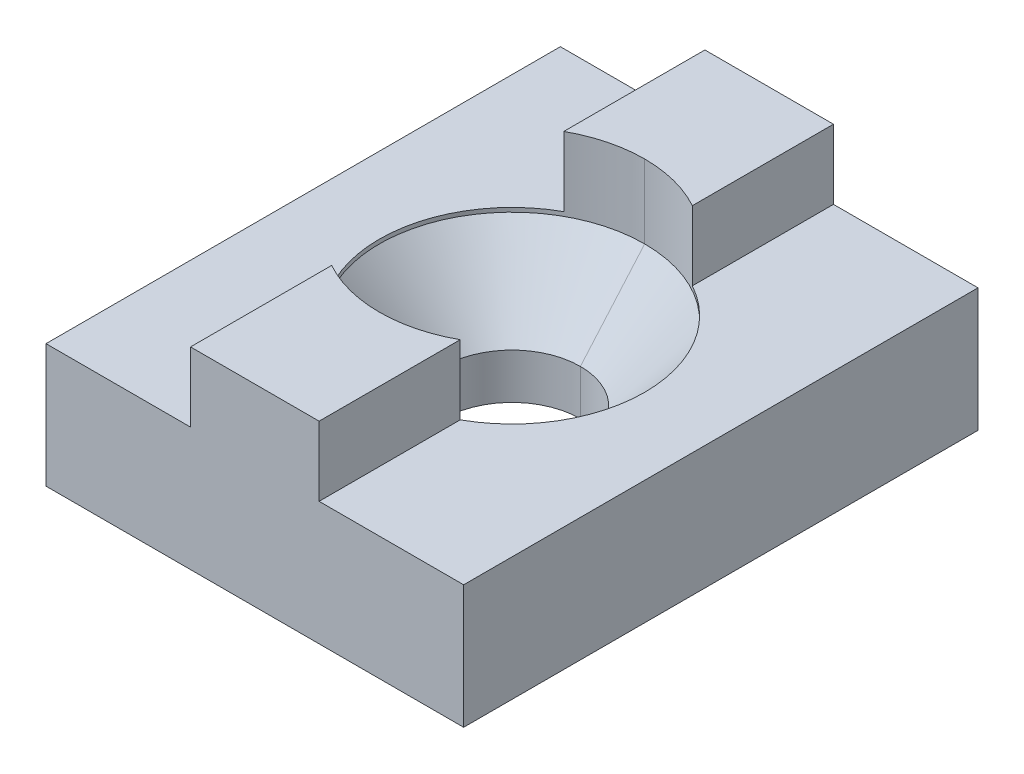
ISO-10303-21;
HEADER;
FILE_DESCRIPTION(('STEP AP214'),'2;1');
FILE_NAME('part.step','',(''),(''),'','','');
FILE_SCHEMA(('AUTOMOTIVE_DESIGN { 1 0 10303 214 1 1 1 1 }'));
ENDSEC;
DATA;
#1=APPLICATION_CONTEXT('core data for automotive mechanical design processes');
#2=APPLICATION_PROTOCOL_DEFINITION('international standard','automotive_design',2000,#1);
#3=PRODUCT_CONTEXT('',#1,'mechanical');
#4=PRODUCT('Part','Part','',(#3));
#5=PRODUCT_RELATED_PRODUCT_CATEGORY('part','',(#4));
#6=PRODUCT_DEFINITION_FORMATION('','',#4);
#7=PRODUCT_DEFINITION_CONTEXT('part definition',#1,'design');
#8=PRODUCT_DEFINITION('design','',#6,#7);
#9=PRODUCT_DEFINITION_SHAPE('','',#8);
#10=(LENGTH_UNIT() NAMED_UNIT(*) SI_UNIT(.MILLI.,.METRE.));
#11=(NAMED_UNIT(*) PLANE_ANGLE_UNIT() SI_UNIT($,.RADIAN.));
#12=(NAMED_UNIT(*) SI_UNIT($,.STERADIAN.) SOLID_ANGLE_UNIT());
#13=UNCERTAINTY_MEASURE_WITH_UNIT(LENGTH_MEASURE(1.E-05),#10,'distance_accuracy_value','');
#14=(GEOMETRIC_REPRESENTATION_CONTEXT(3) GLOBAL_UNCERTAINTY_ASSIGNED_CONTEXT((#13)) GLOBAL_UNIT_ASSIGNED_CONTEXT((#10,
#11,#12)) REPRESENTATION_CONTEXT('',''));
#15=CARTESIAN_POINT('',(0.,0.,0.));
#16=DIRECTION('',(0.,0.,1.));
#17=DIRECTION('',(1.,0.,0.));
#18=AXIS2_PLACEMENT_3D('',#15,#16,#17);
#19=CARTESIAN_POINT('',(-10.3124,0.,12.7));
#20=DIRECTION('',(0.,1.,0.));
#21=DIRECTION('',(0.,0.,1.));
#22=AXIS2_PLACEMENT_3D('',#19,#20,#21);
#23=PLANE('',#22);
#24=CARTESIAN_POINT('',(0.,0.,0.));
#25=DIRECTION('',(0.,-1.,0.));
#26=DIRECTION('',(0.,0.,-1.));
#27=AXIS2_PLACEMENT_3D('',#24,#25,#26);
#28=CIRCLE('',#27,3.3782);
#29=CARTESIAN_POINT('',(0.,0.,-3.3782));
#30=VERTEX_POINT('',#29);
#31=CARTESIAN_POINT('',(0.,0.,3.3782));
#32=VERTEX_POINT('',#31);
#33=EDGE_CURVE('E11',#30,#32,#28,.T.);
#34=ORIENTED_EDGE('',*,*,#33,.F.);
#35=CARTESIAN_POINT('',(0.,0.,0.));
#36=DIRECTION('',(0.,-1.,0.));
#37=DIRECTION('',(0.,0.,-1.));
#38=AXIS2_PLACEMENT_3D('',#35,#36,#37);
#39=CIRCLE('',#38,3.3782);
#40=EDGE_CURVE('E25',#32,#30,#39,.T.);
#41=ORIENTED_EDGE('',*,*,#40,.F.);
#42=EDGE_LOOP('',(#34,#41));
#43=FACE_BOUND('',#42,.T.);
#44=DIRECTION('',(1.,0.,0.));
#45=VECTOR('',#44,1.);
#46=CARTESIAN_POINT('',(-10.3124,0.,-12.7));
#47=LINE('',#46,#45);
#48=CARTESIAN_POINT('',(-10.3124,0.,-12.7));
#49=VERTEX_POINT('',#48);
#50=CARTESIAN_POINT('',(10.3124,0.,-12.7));
#51=VERTEX_POINT('',#50);
#52=EDGE_CURVE('E402',#49,#51,#47,.T.);
#53=ORIENTED_EDGE('',*,*,#52,.T.);
#54=DIRECTION('',(0.,0.,-1.));
#55=VECTOR('',#54,1.);
#56=CARTESIAN_POINT('',(10.3124,0.,12.7));
#57=LINE('',#56,#55);
#58=CARTESIAN_POINT('',(10.3124,0.,12.7));
#59=VERTEX_POINT('',#58);
#60=EDGE_CURVE('E397',#59,#51,#57,.T.);
#61=ORIENTED_EDGE('',*,*,#60,.F.);
#62=DIRECTION('',(1.,0.,0.));
#63=VECTOR('',#62,1.);
#64=CARTESIAN_POINT('',(-10.3124,0.,12.7));
#65=LINE('',#64,#63);
#66=CARTESIAN_POINT('',(-10.3124,0.,12.7));
#67=VERTEX_POINT('',#66);
#68=EDGE_CURVE('E392',#67,#59,#65,.T.);
#69=ORIENTED_EDGE('',*,*,#68,.F.);
#70=DIRECTION('',(0.,0.,-1.));
#71=VECTOR('',#70,1.);
#72=CARTESIAN_POINT('',(-10.3124,0.,12.7));
#73=LINE('',#72,#71);
#74=EDGE_CURVE('E388',#67,#49,#73,.T.);
#75=ORIENTED_EDGE('',*,*,#74,.T.);
#76=EDGE_LOOP('',(#53,#61,#69,#75));
#77=FACE_BOUND('',#76,.T.);
#78=ADVANCED_FACE('F17',(#43,#77),#23,.F.);
#79=CARTESIAN_POINT('',(-10.3124,6.096,12.7));
#80=DIRECTION('',(1.,0.,0.));
#81=DIRECTION('',(0.,0.,-1.));
#82=AXIS2_PLACEMENT_3D('',#79,#80,#81);
#83=PLANE('',#82);
#84=DIRECTION('',(0.,-1.,0.));
#85=VECTOR('',#84,1.);
#86=CARTESIAN_POINT('',(-10.3124,6.096,-12.7));
#87=LINE('',#86,#85);
#88=CARTESIAN_POINT('',(-10.3124,6.096,-12.7));
#89=VERTEX_POINT('',#88);
#90=EDGE_CURVE('E383',#89,#49,#87,.T.);
#91=ORIENTED_EDGE('',*,*,#90,.T.);
#92=ORIENTED_EDGE('',*,*,#74,.F.);
#93=DIRECTION('',(0.,-1.,0.));
#94=VECTOR('',#93,1.);
#95=CARTESIAN_POINT('',(-10.3124,6.096,12.7));
#96=LINE('',#95,#94);
#97=CARTESIAN_POINT('',(-10.3124,6.096,12.7));
#98=VERTEX_POINT('',#97);
#99=EDGE_CURVE('E378',#98,#67,#96,.T.);
#100=ORIENTED_EDGE('',*,*,#99,.F.);
#101=DIRECTION('',(0.,0.,-1.));
#102=VECTOR('',#101,1.);
#103=CARTESIAN_POINT('',(-10.3124,6.096,12.7));
#104=LINE('',#103,#102);
#105=EDGE_CURVE('E374',#98,#89,#104,.T.);
#106=ORIENTED_EDGE('',*,*,#105,.T.);
#107=EDGE_LOOP('',(#91,#92,#100,#106));
#108=FACE_BOUND('',#107,.T.);
#109=ADVANCED_FACE('F427',(#108),#83,.F.);
#110=CARTESIAN_POINT('',(-3.175,6.096,12.7));
#111=DIRECTION('',(0.,-1.,0.));
#112=DIRECTION('',(0.,0.,-1.));
#113=AXIS2_PLACEMENT_3D('',#110,#111,#112);
#114=PLANE('',#113);
#115=CARTESIAN_POINT('',(0.,6.096,0.));
#116=DIRECTION('',(0.,-1.,0.));
#117=DIRECTION('',(0.,0.,-1.));
#118=AXIS2_PLACEMENT_3D('',#115,#116,#117);
#119=CIRCLE('',#118,6.552118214);
#120=CARTESIAN_POINT('',(-3.175,6.096,5.73145950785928));
#121=VERTEX_POINT('',#120);
#122=CARTESIAN_POINT('',(-3.175,6.096,-5.73145950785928));
#123=VERTEX_POINT('',#122);
#124=EDGE_CURVE('E370',#121,#123,#119,.T.);
#125=ORIENTED_EDGE('',*,*,#124,.T.);
#126=DIRECTION('',(0.,0.,-1.));
#127=VECTOR('',#126,1.);
#128=CARTESIAN_POINT('',(-3.175,6.096,12.7));
#129=LINE('',#128,#127);
#130=CARTESIAN_POINT('',(-3.175,6.096,-12.7));
#131=VERTEX_POINT('',#130);
#132=EDGE_CURVE('E366',#123,#131,#129,.T.);
#133=ORIENTED_EDGE('',*,*,#132,.T.);
#134=DIRECTION('',(-1.,0.,0.));
#135=VECTOR('',#134,1.);
#136=CARTESIAN_POINT('',(-3.175,6.096,-12.7));
#137=LINE('',#136,#135);
#138=EDGE_CURVE('E361',#131,#89,#137,.T.);
#139=ORIENTED_EDGE('',*,*,#138,.T.);
#140=ORIENTED_EDGE('',*,*,#105,.F.);
#141=DIRECTION('',(-1.,0.,0.));
#142=VECTOR('',#141,1.);
#143=CARTESIAN_POINT('',(-3.175,6.096,12.7));
#144=LINE('',#143,#142);
#145=CARTESIAN_POINT('',(-3.175,6.096,12.7));
#146=VERTEX_POINT('',#145);
#147=EDGE_CURVE('E356',#146,#98,#144,.T.);
#148=ORIENTED_EDGE('',*,*,#147,.F.);
#149=DIRECTION('',(0.,0.,-1.));
#150=VECTOR('',#149,1.);
#151=CARTESIAN_POINT('',(-3.175,6.096,12.7));
#152=LINE('',#151,#150);
#153=EDGE_CURVE('E352',#146,#121,#152,.T.);
#154=ORIENTED_EDGE('',*,*,#153,.T.);
#155=EDGE_LOOP('',(#125,#133,#139,#140,#148,#154));
#156=FACE_BOUND('',#155,.T.);
#157=ADVANCED_FACE('F455',(#156),#114,.F.);
#158=CARTESIAN_POINT('',(-3.175,9.525,12.7));
#159=DIRECTION('',(1.,0.,0.));
#160=DIRECTION('',(0.,0.,-1.));
#161=AXIS2_PLACEMENT_3D('',#158,#159,#160);
#162=PLANE('',#161);
#163=DIRECTION('',(0.,-1.,0.));
#164=VECTOR('',#163,1.);
#165=CARTESIAN_POINT('',(-3.175,0.,5.73145950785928));
#166=LINE('',#165,#164);
#167=CARTESIAN_POINT('',(-3.175,9.525,5.73145950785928));
#168=VERTEX_POINT('',#167);
#169=EDGE_CURVE('E347',#168,#121,#166,.T.);
#170=ORIENTED_EDGE('',*,*,#169,.T.);
#171=ORIENTED_EDGE('',*,*,#153,.F.);
#172=DIRECTION('',(0.,-1.,0.));
#173=VECTOR('',#172,1.);
#174=CARTESIAN_POINT('',(-3.175,9.525,12.7));
#175=LINE('',#174,#173);
#176=CARTESIAN_POINT('',(-3.175,9.525,12.7));
#177=VERTEX_POINT('',#176);
#178=EDGE_CURVE('E342',#177,#146,#175,.T.);
#179=ORIENTED_EDGE('',*,*,#178,.F.);
#180=DIRECTION('',(0.,0.,-1.));
#181=VECTOR('',#180,1.);
#182=CARTESIAN_POINT('',(-3.175,9.525,12.7));
#183=LINE('',#182,#181);
#184=EDGE_CURVE('E338',#177,#168,#183,.T.);
#185=ORIENTED_EDGE('',*,*,#184,.T.);
#186=EDGE_LOOP('',(#170,#171,#179,#185));
#187=FACE_BOUND('',#186,.T.);
#188=ADVANCED_FACE('F452',(#187),#162,.F.);
#189=CARTESIAN_POINT('',(3.175,9.525,12.7));
#190=DIRECTION('',(0.,-1.,0.));
#191=DIRECTION('',(0.,0.,-1.));
#192=AXIS2_PLACEMENT_3D('',#189,#190,#191);
#193=PLANE('',#192);
#194=CARTESIAN_POINT('',(0.,9.525,0.));
#195=DIRECTION('',(0.,-1.,0.));
#196=DIRECTION('',(0.,0.,-1.));
#197=AXIS2_PLACEMENT_3D('',#194,#195,#196);
#198=CIRCLE('',#197,6.552118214);
#199=CARTESIAN_POINT('',(3.175,9.525,5.73145950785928));
#200=VERTEX_POINT('',#199);
#201=CARTESIAN_POINT('',(0.,9.525,6.552118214));
#202=VERTEX_POINT('',#201);
#203=EDGE_CURVE('E334',#200,#202,#198,.T.);
#204=ORIENTED_EDGE('',*,*,#203,.T.);
#205=CARTESIAN_POINT('',(0.,9.525,0.));
#206=DIRECTION('',(0.,-1.,0.));
#207=DIRECTION('',(0.,0.,-1.));
#208=AXIS2_PLACEMENT_3D('',#205,#206,#207);
#209=CIRCLE('',#208,6.552118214);
#210=EDGE_CURVE('E329',#202,#168,#209,.T.);
#211=ORIENTED_EDGE('',*,*,#210,.T.);
#212=ORIENTED_EDGE('',*,*,#184,.F.);
#213=DIRECTION('',(-1.,0.,0.));
#214=VECTOR('',#213,1.);
#215=CARTESIAN_POINT('',(3.175,9.525,12.7));
#216=LINE('',#215,#214);
#217=CARTESIAN_POINT('',(3.175,9.525,12.7));
#218=VERTEX_POINT('',#217);
#219=EDGE_CURVE('E324',#218,#177,#216,.T.);
#220=ORIENTED_EDGE('',*,*,#219,.F.);
#221=DIRECTION('',(0.,0.,-1.));
#222=VECTOR('',#221,1.);
#223=CARTESIAN_POINT('',(3.175,9.525,12.7));
#224=LINE('',#223,#222);
#225=EDGE_CURVE('E320',#218,#200,#224,.T.);
#226=ORIENTED_EDGE('',*,*,#225,.T.);
#227=EDGE_LOOP('',(#204,#211,#212,#220,#226));
#228=FACE_BOUND('',#227,.T.);
#229=ADVANCED_FACE('F448',(#228),#193,.F.);
#230=CARTESIAN_POINT('',(3.175,6.096,12.7));
#231=DIRECTION('',(-1.,0.,0.));
#232=DIRECTION('',(0.,0.,1.));
#233=AXIS2_PLACEMENT_3D('',#230,#231,#232);
#234=PLANE('',#233);
#235=DIRECTION('',(0.,-1.,0.));
#236=VECTOR('',#235,1.);
#237=CARTESIAN_POINT('',(3.175,0.,5.73145950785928));
#238=LINE('',#237,#236);
#239=CARTESIAN_POINT('',(3.175,6.096,5.73145950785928));
#240=VERTEX_POINT('',#239);
#241=EDGE_CURVE('E315',#200,#240,#238,.T.);
#242=ORIENTED_EDGE('',*,*,#241,.F.);
#243=ORIENTED_EDGE('',*,*,#225,.F.);
#244=DIRECTION('',(0.,1.,0.));
#245=VECTOR('',#244,1.);
#246=CARTESIAN_POINT('',(3.175,6.096,12.7));
#247=LINE('',#246,#245);
#248=CARTESIAN_POINT('',(3.175,6.096,12.7));
#249=VERTEX_POINT('',#248);
#250=EDGE_CURVE('E310',#249,#218,#247,.T.);
#251=ORIENTED_EDGE('',*,*,#250,.F.);
#252=DIRECTION('',(0.,0.,-1.));
#253=VECTOR('',#252,1.);
#254=CARTESIAN_POINT('',(3.175,6.096,12.7));
#255=LINE('',#254,#253);
#256=EDGE_CURVE('E306',#249,#240,#255,.T.);
#257=ORIENTED_EDGE('',*,*,#256,.T.);
#258=EDGE_LOOP('',(#242,#243,#251,#257));
#259=FACE_BOUND('',#258,.T.);
#260=ADVANCED_FACE('F446',(#259),#234,.F.);
#261=CARTESIAN_POINT('',(10.3124,6.096,12.7));
#262=DIRECTION('',(0.,-1.,0.));
#263=DIRECTION('',(0.,0.,-1.));
#264=AXIS2_PLACEMENT_3D('',#261,#262,#263);
#265=PLANE('',#264);
#266=DIRECTION('',(0.,0.,-1.));
#267=VECTOR('',#266,1.);
#268=CARTESIAN_POINT('',(3.175,6.096,12.7));
#269=LINE('',#268,#267);
#270=CARTESIAN_POINT('',(3.175,6.096,-5.73145950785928));
#271=VERTEX_POINT('',#270);
#272=CARTESIAN_POINT('',(3.175,6.096,-12.7));
#273=VERTEX_POINT('',#272);
#274=EDGE_CURVE('E301',#271,#273,#269,.T.);
#275=ORIENTED_EDGE('',*,*,#274,.F.);
#276=CARTESIAN_POINT('',(0.,6.096,0.));
#277=DIRECTION('',(0.,-1.,0.));
#278=DIRECTION('',(0.,0.,-1.));
#279=AXIS2_PLACEMENT_3D('',#276,#277,#278);
#280=CIRCLE('',#279,6.552118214);
#281=EDGE_CURVE('E296',#271,#240,#280,.T.);
#282=ORIENTED_EDGE('',*,*,#281,.T.);
#283=ORIENTED_EDGE('',*,*,#256,.F.);
#284=DIRECTION('',(-1.,0.,0.));
#285=VECTOR('',#284,1.);
#286=CARTESIAN_POINT('',(10.3124,6.096,12.7));
#287=LINE('',#286,#285);
#288=CARTESIAN_POINT('',(10.3124,6.096,12.7));
#289=VERTEX_POINT('',#288);
#290=EDGE_CURVE('E291',#289,#249,#287,.T.);
#291=ORIENTED_EDGE('',*,*,#290,.F.);
#292=DIRECTION('',(0.,0.,-1.));
#293=VECTOR('',#292,1.);
#294=CARTESIAN_POINT('',(10.3124,6.096,12.7));
#295=LINE('',#294,#293);
#296=CARTESIAN_POINT('',(10.3124,6.096,-12.7));
#297=VERTEX_POINT('',#296);
#298=EDGE_CURVE('E287',#289,#297,#295,.T.);
#299=ORIENTED_EDGE('',*,*,#298,.T.);
#300=DIRECTION('',(-1.,0.,0.));
#301=VECTOR('',#300,1.);
#302=CARTESIAN_POINT('',(10.3124,6.096,-12.7));
#303=LINE('',#302,#301);
#304=EDGE_CURVE('E283',#297,#273,#303,.T.);
#305=ORIENTED_EDGE('',*,*,#304,.T.);
#306=EDGE_LOOP('',(#275,#282,#283,#291,#299,#305));
#307=FACE_BOUND('',#306,.T.);
#308=ADVANCED_FACE('F441',(#307),#265,.F.);
#309=CARTESIAN_POINT('',(0.,0.,-12.7));
#310=DIRECTION('',(0.,0.,1.));
#311=DIRECTION('',(1.,0.,0.));
#312=AXIS2_PLACEMENT_3D('',#309,#310,#311);
#313=PLANE('',#312);
#314=ORIENTED_EDGE('',*,*,#138,.F.);
#315=DIRECTION('',(0.,-1.,0.));
#316=VECTOR('',#315,1.);
#317=CARTESIAN_POINT('',(-3.175,9.525,-12.7));
#318=LINE('',#317,#316);
#319=CARTESIAN_POINT('',(-3.175,9.525,-12.7));
#320=VERTEX_POINT('',#319);
#321=EDGE_CURVE('E278',#320,#131,#318,.T.);
#322=ORIENTED_EDGE('',*,*,#321,.F.);
#323=DIRECTION('',(-1.,0.,0.));
#324=VECTOR('',#323,1.);
#325=CARTESIAN_POINT('',(3.175,9.525,-12.7));
#326=LINE('',#325,#324);
#327=CARTESIAN_POINT('',(3.175,9.525,-12.7));
#328=VERTEX_POINT('',#327);
#329=EDGE_CURVE('E273',#328,#320,#326,.T.);
#330=ORIENTED_EDGE('',*,*,#329,.F.);
#331=DIRECTION('',(0.,1.,0.));
#332=VECTOR('',#331,1.);
#333=CARTESIAN_POINT('',(3.175,6.096,-12.7));
#334=LINE('',#333,#332);
#335=EDGE_CURVE('E268',#273,#328,#334,.T.);
#336=ORIENTED_EDGE('',*,*,#335,.F.);
#337=ORIENTED_EDGE('',*,*,#304,.F.);
#338=DIRECTION('',(0.,1.,0.));
#339=VECTOR('',#338,1.);
#340=CARTESIAN_POINT('',(10.3124,0.,-12.7));
#341=LINE('',#340,#339);
#342=EDGE_CURVE('E263',#51,#297,#341,.T.);
#343=ORIENTED_EDGE('',*,*,#342,.F.);
#344=ORIENTED_EDGE('',*,*,#52,.F.);
#345=ORIENTED_EDGE('',*,*,#90,.F.);
#346=EDGE_LOOP('',(#314,#322,#330,#336,#337,#343,#344,#345));
#347=FACE_BOUND('',#346,.T.);
#348=ADVANCED_FACE('F419',(#347),#313,.F.);
#349=CARTESIAN_POINT('',(10.3124,0.,12.7));
#350=DIRECTION('',(-1.,0.,0.));
#351=DIRECTION('',(0.,0.,1.));
#352=AXIS2_PLACEMENT_3D('',#349,#350,#351);
#353=PLANE('',#352);
#354=ORIENTED_EDGE('',*,*,#342,.T.);
#355=ORIENTED_EDGE('',*,*,#298,.F.);
#356=DIRECTION('',(0.,1.,0.));
#357=VECTOR('',#356,1.);
#358=CARTESIAN_POINT('',(10.3124,0.,12.7));
#359=LINE('',#358,#357);
#360=EDGE_CURVE('E258',#59,#289,#359,.T.);
#361=ORIENTED_EDGE('',*,*,#360,.F.);
#362=ORIENTED_EDGE('',*,*,#60,.T.);
#363=EDGE_LOOP('',(#354,#355,#361,#362));
#364=FACE_BOUND('',#363,.T.);
#365=ADVANCED_FACE('F423',(#364),#353,.F.);
#366=CARTESIAN_POINT('',(0.,0.,12.7));
#367=DIRECTION('',(0.,0.,1.));
#368=DIRECTION('',(1.,0.,0.));
#369=AXIS2_PLACEMENT_3D('',#366,#367,#368);
#370=PLANE('',#369);
#371=ORIENTED_EDGE('',*,*,#147,.T.);
#372=ORIENTED_EDGE('',*,*,#99,.T.);
#373=ORIENTED_EDGE('',*,*,#68,.T.);
#374=ORIENTED_EDGE('',*,*,#360,.T.);
#375=ORIENTED_EDGE('',*,*,#290,.T.);
#376=ORIENTED_EDGE('',*,*,#250,.T.);
#377=ORIENTED_EDGE('',*,*,#219,.T.);
#378=ORIENTED_EDGE('',*,*,#178,.T.);
#379=EDGE_LOOP('',(#371,#372,#373,#374,#375,#376,#377,#378));
#380=FACE_BOUND('',#379,.T.);
#381=ADVANCED_FACE('F425',(#380),#370,.T.);
#382=CARTESIAN_POINT('',(3.175,6.096,12.7));
#383=DIRECTION('',(-1.,0.,0.));
#384=DIRECTION('',(0.,0.,1.));
#385=AXIS2_PLACEMENT_3D('',#382,#383,#384);
#386=PLANE('',#385);
#387=DIRECTION('',(0.,-1.,0.));
#388=VECTOR('',#387,1.);
#389=CARTESIAN_POINT('',(3.175,0.,-5.73145950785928));
#390=LINE('',#389,#388);
#391=CARTESIAN_POINT('',(3.175,9.525,-5.73145950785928));
#392=VERTEX_POINT('',#391);
#393=EDGE_CURVE('E253',#392,#271,#390,.T.);
#394=ORIENTED_EDGE('',*,*,#393,.T.);
#395=ORIENTED_EDGE('',*,*,#274,.T.);
#396=ORIENTED_EDGE('',*,*,#335,.T.);
#397=DIRECTION('',(0.,0.,-1.));
#398=VECTOR('',#397,1.);
#399=CARTESIAN_POINT('',(3.175,9.525,12.7));
#400=LINE('',#399,#398);
#401=EDGE_CURVE('E248',#392,#328,#400,.T.);
#402=ORIENTED_EDGE('',*,*,#401,.F.);
#403=EDGE_LOOP('',(#394,#395,#396,#402));
#404=FACE_BOUND('',#403,.T.);
#405=ADVANCED_FACE('F437',(#404),#386,.F.);
#406=CARTESIAN_POINT('',(3.175,9.525,12.7));
#407=DIRECTION('',(0.,-1.,0.));
#408=DIRECTION('',(0.,0.,-1.));
#409=AXIS2_PLACEMENT_3D('',#406,#407,#408);
#410=PLANE('',#409);
#411=CARTESIAN_POINT('',(0.,9.525,0.));
#412=DIRECTION('',(0.,-1.,0.));
#413=DIRECTION('',(0.,0.,-1.));
#414=AXIS2_PLACEMENT_3D('',#411,#412,#413);
#415=CIRCLE('',#414,6.552118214);
#416=CARTESIAN_POINT('',(-3.175,9.525,-5.73145950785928));
#417=VERTEX_POINT('',#416);
#418=CARTESIAN_POINT('',(0.,9.525,-6.552118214));
#419=VERTEX_POINT('',#418);
#420=EDGE_CURVE('E244',#417,#419,#415,.T.);
#421=ORIENTED_EDGE('',*,*,#420,.T.);
#422=CARTESIAN_POINT('',(0.,9.525,0.));
#423=DIRECTION('',(0.,-1.,0.));
#424=DIRECTION('',(0.,0.,-1.));
#425=AXIS2_PLACEMENT_3D('',#422,#423,#424);
#426=CIRCLE('',#425,6.552118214);
#427=EDGE_CURVE('E239',#419,#392,#426,.T.);
#428=ORIENTED_EDGE('',*,*,#427,.T.);
#429=ORIENTED_EDGE('',*,*,#401,.T.);
#430=ORIENTED_EDGE('',*,*,#329,.T.);
#431=DIRECTION('',(0.,0.,-1.));
#432=VECTOR('',#431,1.);
#433=CARTESIAN_POINT('',(-3.175,9.525,12.7));
#434=LINE('',#433,#432);
#435=EDGE_CURVE('E234',#417,#320,#434,.T.);
#436=ORIENTED_EDGE('',*,*,#435,.F.);
#437=EDGE_LOOP('',(#421,#428,#429,#430,#436));
#438=FACE_BOUND('',#437,.T.);
#439=ADVANCED_FACE('F435',(#438),#410,.F.);
#440=CARTESIAN_POINT('',(-3.175,9.525,12.7));
#441=DIRECTION('',(1.,0.,0.));
#442=DIRECTION('',(0.,0.,-1.));
#443=AXIS2_PLACEMENT_3D('',#440,#441,#442);
#444=PLANE('',#443);
#445=DIRECTION('',(0.,-1.,0.));
#446=VECTOR('',#445,1.);
#447=CARTESIAN_POINT('',(-3.175,0.,-5.73145950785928));
#448=LINE('',#447,#446);
#449=EDGE_CURVE('E231',#417,#123,#448,.T.);
#450=ORIENTED_EDGE('',*,*,#449,.F.);
#451=ORIENTED_EDGE('',*,*,#435,.T.);
#452=ORIENTED_EDGE('',*,*,#321,.T.);
#453=ORIENTED_EDGE('',*,*,#132,.F.);
#454=EDGE_LOOP('',(#450,#451,#452,#453));
#455=FACE_BOUND('',#454,.T.);
#456=ADVANCED_FACE('F433',(#455),#444,.F.);
#457=CARTESIAN_POINT('',(0.,0.,0.));
#458=DIRECTION('',(0.,1.,0.));
#459=DIRECTION('',(1.,0.,0.));
#460=AXIS2_PLACEMENT_3D('',#457,#458,#459);
#461=CYLINDRICAL_SURFACE('',#460,6.552118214);
#462=ORIENTED_EDGE('',*,*,#210,.F.);
#463=CARTESIAN_POINT('',(0.,5.89153,6.552118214));
#464=DIRECTION('',(0.,1.,0.));
#465=VECTOR('',#464,1.);
#466=LINE('',#463,#465);
#467=CARTESIAN_POINT('',(0.,5.89153,6.552118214));
#468=VERTEX_POINT('',#467);
#469=EDGE_CURVE('E200',#468,#202,#466,.T.);
#470=ORIENTED_EDGE('',*,*,#469,.F.);
#471=CARTESIAN_POINT('',(0.,5.89153,0.));
#472=DIRECTION('',(0.,-1.,0.));
#473=DIRECTION('',(0.,0.,-1.));
#474=AXIS2_PLACEMENT_3D('',#471,#472,#473);
#475=CIRCLE('',#474,6.552118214);
#476=CARTESIAN_POINT('',(0.,5.89153,-6.552118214));
#477=VERTEX_POINT('',#476);
#478=EDGE_CURVE('E217',#468,#477,#475,.T.);
#479=ORIENTED_EDGE('',*,*,#478,.T.);
#480=CARTESIAN_POINT('',(0.,5.89153,-6.552118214));
#481=DIRECTION('',(0.,1.,0.));
#482=VECTOR('',#481,1.);
#483=LINE('',#480,#482);
#484=EDGE_CURVE('E161',#477,#419,#483,.T.);
#485=ORIENTED_EDGE('',*,*,#484,.T.);
#486=ORIENTED_EDGE('',*,*,#420,.F.);
#487=ORIENTED_EDGE('',*,*,#449,.T.);
#488=ORIENTED_EDGE('',*,*,#124,.F.);
#489=ORIENTED_EDGE('',*,*,#169,.F.);
#490=EDGE_LOOP('',(#462,#470,#479,#485,#486,#487,#488,#489));
#491=FACE_BOUND('',#490,.T.);
#492=ADVANCED_FACE('F183',(#491),#461,.F.);
#493=CARTESIAN_POINT('',(0.,0.,0.));
#494=DIRECTION('',(0.,1.,0.));
#495=DIRECTION('',(-1.,0.,0.));
#496=AXIS2_PLACEMENT_3D('',#493,#494,#495);
#497=CYLINDRICAL_SURFACE('',#496,6.552118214);
#498=CARTESIAN_POINT('',(0.,5.89153,0.));
#499=DIRECTION('',(0.,-1.,0.));
#500=DIRECTION('',(0.,0.,-1.));
#501=AXIS2_PLACEMENT_3D('',#498,#499,#500);
#502=CIRCLE('',#501,6.552118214);
#503=EDGE_CURVE('E134',#477,#468,#502,.T.);
#504=ORIENTED_EDGE('',*,*,#503,.T.);
#505=ORIENTED_EDGE('',*,*,#469,.T.);
#506=ORIENTED_EDGE('',*,*,#203,.F.);
#507=ORIENTED_EDGE('',*,*,#241,.T.);
#508=ORIENTED_EDGE('',*,*,#281,.F.);
#509=ORIENTED_EDGE('',*,*,#393,.F.);
#510=ORIENTED_EDGE('',*,*,#427,.F.);
#511=ORIENTED_EDGE('',*,*,#484,.F.);
#512=EDGE_LOOP('',(#504,#505,#506,#507,#508,#509,#510,#511));
#513=FACE_BOUND('',#512,.T.);
#514=ADVANCED_FACE('F173',(#513),#497,.F.);
#515=CARTESIAN_POINT('',(0.,5.89153,0.));
#516=DIRECTION('',(0.,1.,0.));
#517=DIRECTION('',(-1.,0.,0.));
#518=AXIS2_PLACEMENT_3D('',#515,#516,#517);
#519=CONICAL_SURFACE('',#518,6.552118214,0.715584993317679);
#520=CARTESIAN_POINT('',(0.,2.2403547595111,0.));
#521=DIRECTION('',(0.,-1.,0.));
#522=DIRECTION('',(0.,0.,-1.));
#523=AXIS2_PLACEMENT_3D('',#520,#521,#522);
#524=CIRCLE('',#523,3.3782);
#525=CARTESIAN_POINT('',(0.,2.2403547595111,-3.3782));
#526=VERTEX_POINT('',#525);
#527=CARTESIAN_POINT('',(0.,2.2403547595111,3.3782));
#528=VERTEX_POINT('',#527);
#529=EDGE_CURVE('E131',#526,#528,#524,.T.);
#530=ORIENTED_EDGE('',*,*,#529,.T.);
#531=CARTESIAN_POINT('',(0.,2.2403547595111,3.3782));
#532=DIRECTION('',(0.,0.754709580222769,0.65605902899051));
#533=VECTOR('',#532,1.);
#534=LINE('',#531,#533);
#535=EDGE_CURVE('E138',#528,#468,#534,.T.);
#536=ORIENTED_EDGE('',*,*,#535,.T.);
#537=ORIENTED_EDGE('',*,*,#503,.F.);
#538=CARTESIAN_POINT('',(0.,2.2403547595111,-3.3782));
#539=DIRECTION('',(0.,0.754709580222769,-0.65605902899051));
#540=VECTOR('',#539,1.);
#541=LINE('',#538,#540);
#542=EDGE_CURVE('E125',#526,#477,#541,.T.);
#543=ORIENTED_EDGE('',*,*,#542,.F.);
#544=EDGE_LOOP('',(#530,#536,#537,#543));
#545=FACE_BOUND('',#544,.T.);
#546=ADVANCED_FACE('F128',(#545),#519,.F.);
#547=CARTESIAN_POINT('',(0.,5.89153,0.));
#548=DIRECTION('',(0.,1.,0.));
#549=DIRECTION('',(1.,0.,0.));
#550=AXIS2_PLACEMENT_3D('',#547,#548,#549);
#551=CONICAL_SURFACE('',#550,6.552118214,0.715584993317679);
#552=ORIENTED_EDGE('',*,*,#478,.F.);
#553=ORIENTED_EDGE('',*,*,#535,.F.);
#554=CARTESIAN_POINT('',(0.,2.2403547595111,0.));
#555=DIRECTION('',(0.,-1.,0.));
#556=DIRECTION('',(0.,0.,-1.));
#557=AXIS2_PLACEMENT_3D('',#554,#555,#556);
#558=CIRCLE('',#557,3.3782);
#559=EDGE_CURVE('E139',#528,#526,#558,.T.);
#560=ORIENTED_EDGE('',*,*,#559,.T.);
#561=ORIENTED_EDGE('',*,*,#542,.T.);
#562=EDGE_LOOP('',(#552,#553,#560,#561));
#563=FACE_BOUND('',#562,.T.);
#564=ADVANCED_FACE('F144',(#563),#551,.F.);
#565=CARTESIAN_POINT('',(0.,0.,0.));
#566=DIRECTION('',(0.,1.,0.));
#567=DIRECTION('',(1.,0.,0.));
#568=AXIS2_PLACEMENT_3D('',#565,#566,#567);
#569=CYLINDRICAL_SURFACE('',#568,3.3782);
#570=ORIENTED_EDGE('',*,*,#559,.F.);
#571=CARTESIAN_POINT('',(0.,0.,3.3782));
#572=DIRECTION('',(0.,1.,0.));
#573=VECTOR('',#572,1.);
#574=LINE('',#571,#573);
#575=EDGE_CURVE('E148',#32,#528,#574,.T.);
#576=ORIENTED_EDGE('',*,*,#575,.F.);
#577=ORIENTED_EDGE('',*,*,#40,.T.);
#578=CARTESIAN_POINT('',(0.,0.,-3.3782));
#579=DIRECTION('',(0.,1.,0.));
#580=VECTOR('',#579,1.);
#581=LINE('',#578,#580);
#582=EDGE_CURVE('E151',#30,#526,#581,.T.);
#583=ORIENTED_EDGE('',*,*,#582,.T.);
#584=EDGE_LOOP('',(#570,#576,#577,#583));
#585=FACE_BOUND('',#584,.T.);
#586=ADVANCED_FACE('F153',(#585),#569,.F.);
#587=CARTESIAN_POINT('',(0.,0.,0.));
#588=DIRECTION('',(0.,1.,0.));
#589=DIRECTION('',(-1.,0.,0.));
#590=AXIS2_PLACEMENT_3D('',#587,#588,#589);
#591=CYLINDRICAL_SURFACE('',#590,3.3782);
#592=ORIENTED_EDGE('',*,*,#33,.T.);
#593=ORIENTED_EDGE('',*,*,#575,.T.);
#594=ORIENTED_EDGE('',*,*,#529,.F.);
#595=ORIENTED_EDGE('',*,*,#582,.F.);
#596=EDGE_LOOP('',(#592,#593,#594,#595));
#597=FACE_BOUND('',#596,.T.);
#598=ADVANCED_FACE('F158',(#597),#591,.F.);
#599=CLOSED_SHELL('',(#78,#109,#157,#188,#229,#260,#308,#348,#365,#381,#405,#439,#456,#492,#514,
#546,#564,#586,#598));
#600=MANIFOLD_SOLID_BREP('B1',#599);
#601=ADVANCED_BREP_SHAPE_REPRESENTATION('',(#18,#600),#14);
#602=SHAPE_DEFINITION_REPRESENTATION(#9,#601);
ENDSEC;
END-ISO-10303-21;
